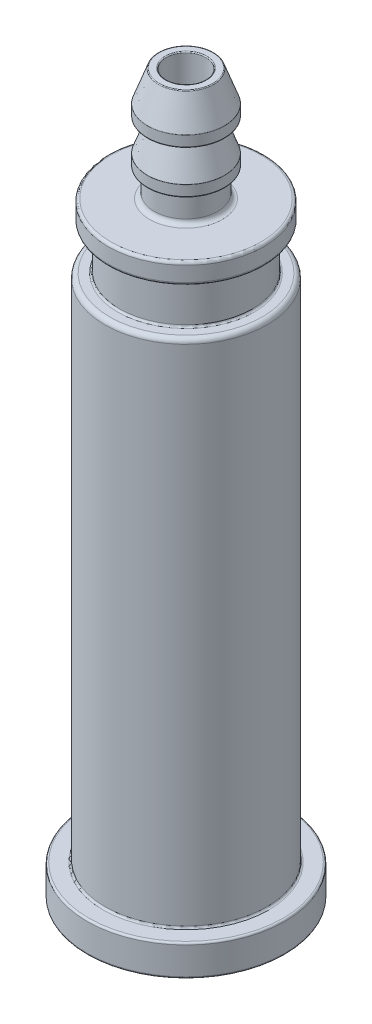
from build123d import *

# Parameters (mm, degrees)
CONG_1_R = 0.3
CONG_2_R = 0.2
CONG_3_R = 0.5
CONG_4_R = 0.5
CONG_5_R = 0.1
CONG_6_R = 0.2


with BuildPart() as part:
    # Esquisse1 → R_volution1 (revolve)
    with BuildSketch(Plane.XY, mode=Mode.PRIVATE) as r_volution1_sk:
        Polygon((7.625, 53.4), (7.625, 0.5), (8.75, 0.5), (9.35, 0), (9.65, 0), (10.25, 0.5), (10.6, 0.5), (10.6, 3.85), (8.675, 3.85), (8.675, 58.5), (7.1, 58.5), (7.1, 63.2), (8.35, 63.2), (8.35, 65.4), (3.4, 65.4), (3.4, 68.4), (4.125, 68.4), (4.125, 69.6), (3.069486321, 72.5), (3.069486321, 73), (4.125, 73), (4.125, 74.2), (2.923898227, 77.5), (2.125, 77.5), (2.125, 63.4), (4.5, 63.4), (4.5, 53.4), align=None)
    revolve(r_volution1_sk.sketch.rotate(Axis((0, 0, 0), (0, 1, 0)), 90), axis=Axis((0, 0, 0), (0, 1, 0)))

    # Cong_1
    cong_1_edges = [part.edges().sort_by_distance(p)[0] for p in [
        (0, 65.4, 8.35),
        (0, 63.2, 8.35),
    ]]
    fillet(cong_1_edges, radius=CONG_1_R)

    # Cong_2
    cong_2_edges = [part.edges().sort_by_distance(p)[0] for p in [
        (0, 63.2, 7.1),
        (0, 58.5, 7.1),
    ]]
    fillet(cong_2_edges, radius=CONG_2_R)

    # Cong_3
    cong_3_edges = [part.edges().sort_by_distance(p)[0] for p in [
        (0, 58.5, 8.675),
    ]]
    fillet(cong_3_edges, radius=CONG_3_R)

    # Cong_4
    cong_4_edges = [part.edges().sort_by_distance(p)[0] for p in [
        (0, 65.4, 3.4),
    ]]
    fillet(cong_4_edges, radius=CONG_4_R)

    # Cong_5
    cong_5_edges = [part.edges().sort_by_distance(p)[0] for p in [
        (0, 77.5, 2.125),
        (0, 77.5, 2.923898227),
        (0, 74.2, 4.125),
        (0, 73, 4.125),
        (0, 73, 3.069486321),
        (0, 69.6, 4.125),
        (0, 68.4, 4.125),
        (0, 68.4, 3.4),
    ]]
    fillet(cong_5_edges, radius=CONG_5_R)

    # Cong_6
    cong_6_edges = [part.edges().sort_by_distance(p)[0] for p in [
        (0, 0.5, 7.625),
        (0, 3.85, 8.675),
        (0, 3.85, 10.6),
        (0, 0.5, 10.6),
        (0, 0.5, 10.25),
        (0, 0, 9.65),
        (0, 0, 9.35),
        (0, 0.5, 8.75),
    ]]
    fillet(cong_6_edges, radius=CONG_6_R)


solid = part.part
